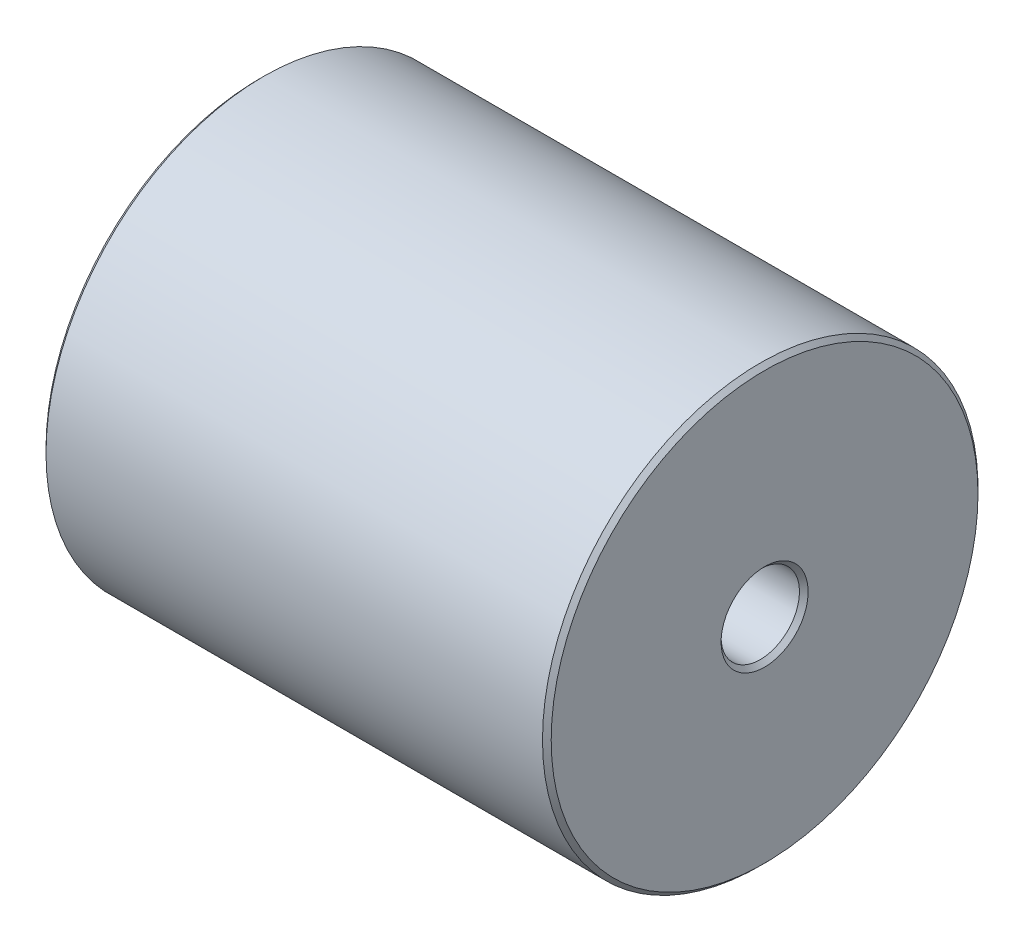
ISO-10303-21;
HEADER;
FILE_DESCRIPTION(('STEP AP214'),'2;1');
FILE_NAME('part.step','',(''),(''),'','','');
FILE_SCHEMA(('AUTOMOTIVE_DESIGN { 1 0 10303 214 1 1 1 1 }'));
ENDSEC;
DATA;
#1=APPLICATION_CONTEXT('core data for automotive mechanical design processes');
#2=APPLICATION_PROTOCOL_DEFINITION('international standard','automotive_design',2000,#1);
#3=PRODUCT_CONTEXT('',#1,'mechanical');
#4=PRODUCT('Part','Part','',(#3));
#5=PRODUCT_RELATED_PRODUCT_CATEGORY('part','',(#4));
#6=PRODUCT_DEFINITION_FORMATION('','',#4);
#7=PRODUCT_DEFINITION_CONTEXT('part definition',#1,'design');
#8=PRODUCT_DEFINITION('design','',#6,#7);
#9=PRODUCT_DEFINITION_SHAPE('','',#8);
#10=(LENGTH_UNIT() NAMED_UNIT(*) SI_UNIT(.MILLI.,.METRE.));
#11=(NAMED_UNIT(*) PLANE_ANGLE_UNIT() SI_UNIT($,.RADIAN.));
#12=(NAMED_UNIT(*) SI_UNIT($,.STERADIAN.) SOLID_ANGLE_UNIT());
#13=UNCERTAINTY_MEASURE_WITH_UNIT(LENGTH_MEASURE(1.E-05),#10,'distance_accuracy_value','');
#14=(GEOMETRIC_REPRESENTATION_CONTEXT(3) GLOBAL_UNCERTAINTY_ASSIGNED_CONTEXT((#13)) GLOBAL_UNIT_ASSIGNED_CONTEXT((#10,
#11,#12)) REPRESENTATION_CONTEXT('',''));
#15=CARTESIAN_POINT('',(0.,0.,0.));
#16=DIRECTION('',(0.,0.,1.));
#17=DIRECTION('',(1.,0.,0.));
#18=AXIS2_PLACEMENT_3D('',#15,#16,#17);
#19=CARTESIAN_POINT('',(0.,0.,0.));
#20=DIRECTION('',(-1.,0.,0.));
#21=DIRECTION('',(0.,0.,1.));
#22=AXIS2_PLACEMENT_3D('',#19,#20,#21);
#23=CYLINDRICAL_SURFACE('',#22,13.);
#24=CARTESIAN_POINT('',(1.,0.,0.));
#25=DIRECTION('',(1.,0.,0.));
#26=DIRECTION('',(0.,0.,-1.));
#27=AXIS2_PLACEMENT_3D('',#24,#25,#26);
#28=CIRCLE('',#27,13.);
#29=CARTESIAN_POINT('',(1.,0.,-13.));
#30=VERTEX_POINT('',#29);
#31=EDGE_CURVE('E25',#30,#30,#28,.F.);
#32=ORIENTED_EDGE('',*,*,#31,.T.);
#33=EDGE_LOOP('',(#32));
#34=FACE_BOUND('',#33,.T.);
#35=CARTESIAN_POINT('',(18.,0.,0.));
#36=DIRECTION('',(-1.,0.,0.));
#37=DIRECTION('',(0.,0.,1.));
#38=AXIS2_PLACEMENT_3D('',#35,#36,#37);
#39=CIRCLE('',#38,13.);
#40=CARTESIAN_POINT('',(18.,0.,13.));
#41=VERTEX_POINT('',#40);
#42=EDGE_CURVE('E49',#41,#41,#39,.T.);
#43=ORIENTED_EDGE('',*,*,#42,.F.);
#44=EDGE_LOOP('',(#43));
#45=FACE_BOUND('',#44,.T.);
#46=ADVANCED_FACE('F14',(#34,#45),#23,.F.);
#47=CARTESIAN_POINT('',(0.,13.,0.));
#48=DIRECTION('',(1.,0.,0.));
#49=DIRECTION('',(0.,0.,-1.));
#50=AXIS2_PLACEMENT_3D('',#47,#48,#49);
#51=PLANE('',#50);
#52=CARTESIAN_POINT('',(0.,0.,0.));
#53=DIRECTION('',(1.,0.,0.));
#54=DIRECTION('',(0.,0.,-1.));
#55=AXIS2_PLACEMENT_3D('',#52,#53,#54);
#56=CIRCLE('',#55,49.);
#57=CARTESIAN_POINT('',(0.,0.,-49.));
#58=VERTEX_POINT('',#57);
#59=EDGE_CURVE('E34',#58,#58,#56,.F.);
#60=ORIENTED_EDGE('',*,*,#59,.T.);
#61=EDGE_LOOP('',(#60));
#62=FACE_BOUND('',#61,.T.);
#63=CARTESIAN_POINT('',(0.,0.,0.));
#64=DIRECTION('',(1.,0.,0.));
#65=DIRECTION('',(0.,0.,-1.));
#66=AXIS2_PLACEMENT_3D('',#63,#64,#65);
#67=CIRCLE('',#66,14.);
#68=CARTESIAN_POINT('',(0.,0.,-14.));
#69=VERTEX_POINT('',#68);
#70=EDGE_CURVE('E37',#69,#69,#67,.T.);
#71=ORIENTED_EDGE('',*,*,#70,.T.);
#72=EDGE_LOOP('',(#71));
#73=FACE_BOUND('',#72,.T.);
#74=ADVANCED_FACE('F56',(#62,#73),#51,.F.);
#75=CARTESIAN_POINT('',(0.,0.,0.));
#76=DIRECTION('',(-1.,0.,0.));
#77=DIRECTION('',(0.,0.,1.));
#78=AXIS2_PLACEMENT_3D('',#75,#76,#77);
#79=CYLINDRICAL_SURFACE('',#78,50.);
#80=CARTESIAN_POINT('',(1.,0.,0.));
#81=DIRECTION('',(1.,0.,0.));
#82=DIRECTION('',(0.,0.,-1.));
#83=AXIS2_PLACEMENT_3D('',#80,#81,#82);
#84=CIRCLE('',#83,50.);
#85=CARTESIAN_POINT('',(1.,0.,-50.));
#86=VERTEX_POINT('',#85);
#87=EDGE_CURVE('E29',#86,#86,#84,.T.);
#88=ORIENTED_EDGE('',*,*,#87,.T.);
#89=EDGE_LOOP('',(#88));
#90=FACE_BOUND('',#89,.T.);
#91=CARTESIAN_POINT('',(115.,0.,0.));
#92=DIRECTION('',(-1.,0.,0.));
#93=DIRECTION('',(0.,0.,1.));
#94=AXIS2_PLACEMENT_3D('',#91,#92,#93);
#95=CIRCLE('',#94,50.);
#96=CARTESIAN_POINT('',(115.,0.,50.));
#97=VERTEX_POINT('',#96);
#98=EDGE_CURVE('E43',#97,#97,#95,.T.);
#99=ORIENTED_EDGE('',*,*,#98,.T.);
#100=EDGE_LOOP('',(#99));
#101=FACE_BOUND('',#100,.T.);
#102=ADVANCED_FACE('F64',(#90,#101),#79,.T.);
#103=CARTESIAN_POINT('',(116.,50.,0.));
#104=DIRECTION('',(-1.,0.,0.));
#105=DIRECTION('',(0.,0.,1.));
#106=AXIS2_PLACEMENT_3D('',#103,#104,#105);
#107=PLANE('',#106);
#108=CARTESIAN_POINT('',(116.,0.,0.));
#109=DIRECTION('',(-1.,0.,0.));
#110=DIRECTION('',(0.,0.,1.));
#111=AXIS2_PLACEMENT_3D('',#108,#109,#110);
#112=CIRCLE('',#111,10.);
#113=CARTESIAN_POINT('',(116.,0.,10.));
#114=VERTEX_POINT('',#113);
#115=EDGE_CURVE('E21',#114,#114,#112,.T.);
#116=ORIENTED_EDGE('',*,*,#115,.T.);
#117=EDGE_LOOP('',(#116));
#118=FACE_BOUND('',#117,.T.);
#119=CARTESIAN_POINT('',(116.,0.,0.));
#120=DIRECTION('',(-1.,0.,0.));
#121=DIRECTION('',(0.,0.,1.));
#122=AXIS2_PLACEMENT_3D('',#119,#120,#121);
#123=CIRCLE('',#122,49.);
#124=CARTESIAN_POINT('',(116.,0.,49.));
#125=VERTEX_POINT('',#124);
#126=EDGE_CURVE('E40',#125,#125,#123,.F.);
#127=ORIENTED_EDGE('',*,*,#126,.T.);
#128=EDGE_LOOP('',(#127));
#129=FACE_BOUND('',#128,.T.);
#130=ADVANCED_FACE('F110',(#118,#129),#107,.F.);
#131=CARTESIAN_POINT('',(0.,0.,0.));
#132=DIRECTION('',(-1.,0.,0.));
#133=DIRECTION('',(0.,0.,1.));
#134=AXIS2_PLACEMENT_3D('',#131,#132,#133);
#135=CYLINDRICAL_SURFACE('',#134,9.);
#136=CARTESIAN_POINT('',(115.,0.,0.));
#137=DIRECTION('',(-1.,0.,0.));
#138=DIRECTION('',(0.,0.,1.));
#139=AXIS2_PLACEMENT_3D('',#136,#137,#138);
#140=CIRCLE('',#139,9.);
#141=CARTESIAN_POINT('',(115.,0.,9.));
#142=VERTEX_POINT('',#141);
#143=EDGE_CURVE('E9',#142,#142,#140,.F.);
#144=ORIENTED_EDGE('',*,*,#143,.T.);
#145=EDGE_LOOP('',(#144));
#146=FACE_BOUND('',#145,.T.);
#147=CARTESIAN_POINT('',(18.,0.,0.));
#148=DIRECTION('',(-1.,0.,0.));
#149=DIRECTION('',(0.,0.,1.));
#150=AXIS2_PLACEMENT_3D('',#147,#148,#149);
#151=CIRCLE('',#150,9.);
#152=CARTESIAN_POINT('',(18.,0.,9.));
#153=VERTEX_POINT('',#152);
#154=EDGE_CURVE('E46',#153,#153,#151,.T.);
#155=ORIENTED_EDGE('',*,*,#154,.T.);
#156=EDGE_LOOP('',(#155));
#157=FACE_BOUND('',#156,.T.);
#158=ADVANCED_FACE('F105',(#146,#157),#135,.F.);
#159=CARTESIAN_POINT('',(18.,13.,0.));
#160=DIRECTION('',(1.,0.,0.));
#161=DIRECTION('',(0.,0.,-1.));
#162=AXIS2_PLACEMENT_3D('',#159,#160,#161);
#163=PLANE('',#162);
#164=ORIENTED_EDGE('',*,*,#154,.F.);
#165=EDGE_LOOP('',(#164));
#166=FACE_BOUND('',#165,.T.);
#167=ORIENTED_EDGE('',*,*,#42,.T.);
#168=EDGE_LOOP('',(#167));
#169=FACE_BOUND('',#168,.T.);
#170=ADVANCED_FACE('F53',(#166,#169),#163,.F.);
#171=CARTESIAN_POINT('',(115.,0.,0.));
#172=DIRECTION('',(-1.,0.,0.));
#173=DIRECTION('',(0.,0.,1.));
#174=AXIS2_PLACEMENT_3D('',#171,#172,#173);
#175=CONICAL_SURFACE('',#174,50.,0.785398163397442);
#176=ORIENTED_EDGE('',*,*,#126,.F.);
#177=EDGE_LOOP('',(#176));
#178=FACE_BOUND('',#177,.T.);
#179=ORIENTED_EDGE('',*,*,#98,.F.);
#180=EDGE_LOOP('',(#179));
#181=FACE_BOUND('',#180,.T.);
#182=ADVANCED_FACE('F69',(#178,#181),#175,.T.);
#183=CARTESIAN_POINT('',(0.,0.,0.));
#184=DIRECTION('',(1.,0.,0.));
#185=DIRECTION('',(0.,0.,-1.));
#186=AXIS2_PLACEMENT_3D('',#183,#184,#185);
#187=CONICAL_SURFACE('',#186,49.,0.785398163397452);
#188=ORIENTED_EDGE('',*,*,#87,.F.);
#189=EDGE_LOOP('',(#188));
#190=FACE_BOUND('',#189,.T.);
#191=ORIENTED_EDGE('',*,*,#59,.F.);
#192=EDGE_LOOP('',(#191));
#193=FACE_BOUND('',#192,.T.);
#194=ADVANCED_FACE('F72',(#190,#193),#187,.T.);
#195=CARTESIAN_POINT('',(1.,0.,0.));
#196=DIRECTION('',(-1.,0.,0.));
#197=DIRECTION('',(0.,0.,1.));
#198=AXIS2_PLACEMENT_3D('',#195,#196,#197);
#199=CONICAL_SURFACE('',#198,13.,0.785398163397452);
#200=ORIENTED_EDGE('',*,*,#70,.F.);
#201=EDGE_LOOP('',(#200));
#202=FACE_BOUND('',#201,.T.);
#203=ORIENTED_EDGE('',*,*,#31,.F.);
#204=EDGE_LOOP('',(#203));
#205=FACE_BOUND('',#204,.T.);
#206=ADVANCED_FACE('F75',(#202,#205),#199,.F.);
#207=CARTESIAN_POINT('',(116.,0.,0.));
#208=DIRECTION('',(1.,0.,0.));
#209=DIRECTION('',(0.,0.,-1.));
#210=AXIS2_PLACEMENT_3D('',#207,#208,#209);
#211=CONICAL_SURFACE('',#210,10.,0.785398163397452);
#212=ORIENTED_EDGE('',*,*,#143,.F.);
#213=EDGE_LOOP('',(#212));
#214=FACE_BOUND('',#213,.T.);
#215=ORIENTED_EDGE('',*,*,#115,.F.);
#216=EDGE_LOOP('',(#215));
#217=FACE_BOUND('',#216,.T.);
#218=ADVANCED_FACE('F16',(#214,#217),#211,.F.);
#219=CLOSED_SHELL('',(#46,#74,#102,#130,#158,#170,#182,#194,#206,#218));
#220=MANIFOLD_SOLID_BREP('B1',#219);
#221=ADVANCED_BREP_SHAPE_REPRESENTATION('',(#18,#220),#14);
#222=SHAPE_DEFINITION_REPRESENTATION(#9,#221);
ENDSEC;
END-ISO-10303-21;
